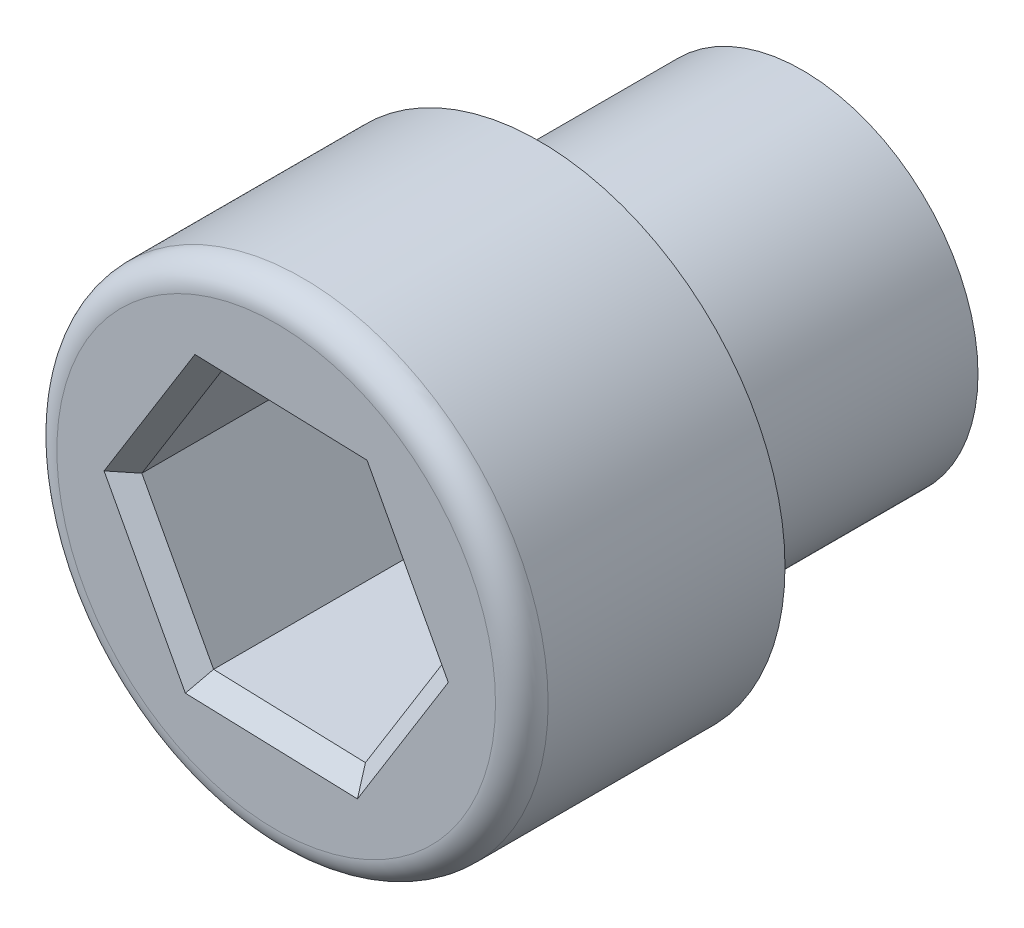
ISO-10303-21;
HEADER;
FILE_DESCRIPTION(('STEP AP214'),'2;1');
FILE_NAME('part.step','',(''),(''),'','','');
FILE_SCHEMA(('AUTOMOTIVE_DESIGN { 1 0 10303 214 1 1 1 1 }'));
ENDSEC;
DATA;
#1=APPLICATION_CONTEXT('core data for automotive mechanical design processes');
#2=APPLICATION_PROTOCOL_DEFINITION('international standard','automotive_design',2000,#1);
#3=PRODUCT_CONTEXT('',#1,'mechanical');
#4=PRODUCT('Part','Part','',(#3));
#5=PRODUCT_RELATED_PRODUCT_CATEGORY('part','',(#4));
#6=PRODUCT_DEFINITION_FORMATION('','',#4);
#7=PRODUCT_DEFINITION_CONTEXT('part definition',#1,'design');
#8=PRODUCT_DEFINITION('design','',#6,#7);
#9=PRODUCT_DEFINITION_SHAPE('','',#8);
#10=(LENGTH_UNIT() NAMED_UNIT(*) SI_UNIT(.MILLI.,.METRE.));
#11=(NAMED_UNIT(*) PLANE_ANGLE_UNIT() SI_UNIT($,.RADIAN.));
#12=(NAMED_UNIT(*) SI_UNIT($,.STERADIAN.) SOLID_ANGLE_UNIT());
#13=UNCERTAINTY_MEASURE_WITH_UNIT(LENGTH_MEASURE(1.E-05),#10,'distance_accuracy_value','');
#14=(GEOMETRIC_REPRESENTATION_CONTEXT(3) GLOBAL_UNCERTAINTY_ASSIGNED_CONTEXT((#13)) GLOBAL_UNIT_ASSIGNED_CONTEXT((#10,
#11,#12)) REPRESENTATION_CONTEXT('',''));
#15=CARTESIAN_POINT('',(0.,0.,0.));
#16=DIRECTION('',(0.,0.,1.));
#17=DIRECTION('',(1.,0.,0.));
#18=AXIS2_PLACEMENT_3D('',#15,#16,#17);
#19=CARTESIAN_POINT('',(0.,0.,3.));
#20=DIRECTION('',(0.,0.,-1.));
#21=DIRECTION('',(-1.,0.,0.));
#22=AXIS2_PLACEMENT_3D('',#19,#20,#21);
#23=CYLINDRICAL_SURFACE('',#22,2.);
#24=CARTESIAN_POINT('',(0.,0.,3.));
#25=DIRECTION('',(0.,0.,1.));
#26=DIRECTION('',(1.,0.,0.));
#27=AXIS2_PLACEMENT_3D('',#24,#25,#26);
#28=CIRCLE('',#27,2.);
#29=CARTESIAN_POINT('',(2.,0.,3.));
#30=VERTEX_POINT('',#29);
#31=EDGE_CURVE('E154',#30,#30,#28,.T.);
#32=ORIENTED_EDGE('',*,*,#31,.F.);
#33=EDGE_LOOP('',(#32));
#34=FACE_BOUND('',#33,.T.);
#35=CARTESIAN_POINT('',(0.,0.,0.));
#36=DIRECTION('',(0.,0.,1.));
#37=DIRECTION('',(1.,0.,0.));
#38=AXIS2_PLACEMENT_3D('',#35,#36,#37);
#39=CIRCLE('',#38,2.);
#40=CARTESIAN_POINT('',(2.,0.,0.));
#41=VERTEX_POINT('',#40);
#42=EDGE_CURVE('E153',#41,#41,#39,.T.);
#43=ORIENTED_EDGE('',*,*,#42,.T.);
#44=EDGE_LOOP('',(#43));
#45=FACE_BOUND('',#44,.T.);
#46=ADVANCED_FACE('F33',(#34,#45),#23,.T.);
#47=CARTESIAN_POINT('',(0.,0.,0.));
#48=DIRECTION('',(0.,0.,1.));
#49=DIRECTION('',(1.,0.,0.));
#50=AXIS2_PLACEMENT_3D('',#47,#48,#49);
#51=PLANE('',#50);
#52=ORIENTED_EDGE('',*,*,#42,.F.);
#53=EDGE_LOOP('',(#52));
#54=FACE_BOUND('',#53,.T.);
#55=ADVANCED_FACE('F231',(#54),#51,.F.);
#56=CARTESIAN_POINT('',(0.,0.,6.));
#57=DIRECTION('',(0.,0.,-1.));
#58=DIRECTION('',(-1.,0.,0.));
#59=AXIS2_PLACEMENT_3D('',#56,#57,#58);
#60=CYLINDRICAL_SURFACE('',#59,2.8);
#61=CARTESIAN_POINT('',(0.,0.,5.7));
#62=DIRECTION('',(0.,0.,1.));
#63=DIRECTION('',(1.,0.,0.));
#64=AXIS2_PLACEMENT_3D('',#61,#62,#63);
#65=CIRCLE('',#64,2.8);
#66=CARTESIAN_POINT('',(2.8,0.,5.7));
#67=VERTEX_POINT('',#66);
#68=EDGE_CURVE('E162',#67,#67,#65,.F.);
#69=ORIENTED_EDGE('',*,*,#68,.T.);
#70=EDGE_LOOP('',(#69));
#71=FACE_BOUND('',#70,.T.);
#72=CARTESIAN_POINT('',(0.,0.,3.));
#73=DIRECTION('',(0.,0.,1.));
#74=DIRECTION('',(1.,0.,0.));
#75=AXIS2_PLACEMENT_3D('',#72,#73,#74);
#76=CIRCLE('',#75,2.8);
#77=CARTESIAN_POINT('',(2.8,0.,3.));
#78=VERTEX_POINT('',#77);
#79=EDGE_CURVE('E142',#78,#78,#76,.T.);
#80=ORIENTED_EDGE('',*,*,#79,.T.);
#81=EDGE_LOOP('',(#80));
#82=FACE_BOUND('',#81,.T.);
#83=ADVANCED_FACE('F237',(#71,#82),#60,.T.);
#84=CARTESIAN_POINT('',(0.,0.,6.));
#85=DIRECTION('',(0.,0.,1.));
#86=DIRECTION('',(1.,0.,0.));
#87=AXIS2_PLACEMENT_3D('',#84,#85,#86);
#88=PLANE('',#87);
#89=DIRECTION('',(-0.527537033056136,-0.849532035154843,0.));
#90=VECTOR('',#89,1.);
#91=CARTESIAN_POINT('',(0.987343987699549,-1.63252927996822,6.));
#92=LINE('',#91,#90);
#93=CARTESIAN_POINT('',(1.96197966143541,-0.0630011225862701,6.));
#94=VERTEX_POINT('',#93);
#95=CARTESIAN_POINT('',(0.926429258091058,-1.73062478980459,6.));
#96=VERTEX_POINT('',#95);
#97=EDGE_CURVE('E168',#94,#96,#92,.T.);
#98=ORIENTED_EDGE('',*,*,#97,.T.);
#99=DIRECTION('',(-0.999484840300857,0.0320944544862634,0.));
#100=VECTOR('',#99,1.);
#101=CARTESIAN_POINT('',(-0.920139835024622,-1.67132961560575,6.));
#102=LINE('',#101,#100);
#103=CARTESIAN_POINT('',(-1.03555040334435,-1.66762366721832,6.));
#104=VERTEX_POINT('',#103);
#105=EDGE_CURVE('E178',#96,#104,#102,.T.);
#106=ORIENTED_EDGE('',*,*,#105,.T.);
#107=DIRECTION('',(-0.471947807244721,0.881626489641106,0.));
#108=VECTOR('',#107,1.);
#109=CARTESIAN_POINT('',(-1.90748382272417,-0.0388003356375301,6.));
#110=LINE('',#109,#108);
#111=CARTESIAN_POINT('',(-1.96197966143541,0.0630011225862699,6.));
#112=VERTEX_POINT('',#111);
#113=EDGE_CURVE('E176',#104,#112,#110,.T.);
#114=ORIENTED_EDGE('',*,*,#113,.T.);
#115=DIRECTION('',(0.527537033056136,0.849532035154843,0.));
#116=VECTOR('',#115,1.);
#117=CARTESIAN_POINT('',(-0.987343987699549,1.63252927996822,6.));
#118=LINE('',#117,#116);
#119=CARTESIAN_POINT('',(-0.926429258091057,1.73062478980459,6.));
#120=VERTEX_POINT('',#119);
#121=EDGE_CURVE('E174',#112,#120,#118,.T.);
#122=ORIENTED_EDGE('',*,*,#121,.T.);
#123=DIRECTION('',(0.999484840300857,-0.0320944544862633,0.));
#124=VECTOR('',#123,1.);
#125=CARTESIAN_POINT('',(0.920139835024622,1.67132961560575,6.));
#126=LINE('',#125,#124);
#127=CARTESIAN_POINT('',(1.03555040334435,1.66762366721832,6.));
#128=VERTEX_POINT('',#127);
#129=EDGE_CURVE('E172',#120,#128,#126,.T.);
#130=ORIENTED_EDGE('',*,*,#129,.T.);
#131=DIRECTION('',(0.471947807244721,-0.881626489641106,0.));
#132=VECTOR('',#131,1.);
#133=CARTESIAN_POINT('',(1.90748382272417,0.03880033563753,6.));
#134=LINE('',#133,#132);
#135=EDGE_CURVE('E170',#128,#94,#134,.T.);
#136=ORIENTED_EDGE('',*,*,#135,.T.);
#137=EDGE_LOOP('',(#98,#106,#114,#122,#130,#136));
#138=FACE_BOUND('',#137,.T.);
#139=CARTESIAN_POINT('',(0.,0.,6.));
#140=DIRECTION('',(0.,0.,1.));
#141=DIRECTION('',(1.,0.,0.));
#142=AXIS2_PLACEMENT_3D('',#139,#140,#141);
#143=CIRCLE('',#142,2.5);
#144=CARTESIAN_POINT('',(2.5,0.,6.));
#145=VERTEX_POINT('',#144);
#146=EDGE_CURVE('E157',#145,#145,#143,.T.);
#147=ORIENTED_EDGE('',*,*,#146,.T.);
#148=EDGE_LOOP('',(#147));
#149=FACE_BOUND('',#148,.T.);
#150=ADVANCED_FACE('F278',(#138,#149),#88,.T.);
#151=CARTESIAN_POINT('',(0.,0.,3.));
#152=DIRECTION('',(0.,0.,1.));
#153=DIRECTION('',(1.,0.,0.));
#154=AXIS2_PLACEMENT_3D('',#151,#152,#153);
#155=PLANE('',#154);
#156=ORIENTED_EDGE('',*,*,#31,.T.);
#157=EDGE_LOOP('',(#156));
#158=FACE_BOUND('',#157,.T.);
#159=ORIENTED_EDGE('',*,*,#79,.F.);
#160=EDGE_LOOP('',(#159));
#161=FACE_BOUND('',#160,.T.);
#162=ADVANCED_FACE('F246',(#158,#161),#155,.F.);
#163=CARTESIAN_POINT('',(0.,0.,5.7));
#164=DIRECTION('',(0.,0.,1.));
#165=DIRECTION('',(1.,0.,0.));
#166=AXIS2_PLACEMENT_3D('',#163,#164,#165);
#167=TOROIDAL_SURFACE('',#166,2.5,0.3);
#168=ORIENTED_EDGE('',*,*,#68,.F.);
#169=EDGE_LOOP('',(#168));
#170=FACE_BOUND('',#169,.T.);
#171=ORIENTED_EDGE('',*,*,#146,.F.);
#172=EDGE_LOOP('',(#171));
#173=FACE_BOUND('',#172,.T.);
#174=ADVANCED_FACE('F227',(#170,#173),#167,.T.);
#175=CARTESIAN_POINT('',(0.91372094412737,1.47143264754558,3.));
#176=DIRECTION('',(0.0320944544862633,0.999484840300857,0.));
#177=DIRECTION('',(-0.999484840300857,0.0320944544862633,0.));
#178=AXIS2_PLACEMENT_3D('',#175,#176,#177);
#179=PLANE('',#178);
#180=DIRECTION('',(0.,0.,1.));
#181=VECTOR('',#180,1.);
#182=CARTESIAN_POINT('',(0.91372094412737,1.47143264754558,3.));
#183=LINE('',#182,#181);
#184=CARTESIAN_POINT('',(0.91372094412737,1.47143264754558,3.));
#185=VERTEX_POINT('',#184);
#186=CARTESIAN_POINT('',(0.91372094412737,1.47143264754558,5.8));
#187=VERTEX_POINT('',#186);
#188=EDGE_CURVE('E140',#185,#187,#183,.T.);
#189=ORIENTED_EDGE('',*,*,#188,.T.);
#190=DIRECTION('',(-0.999484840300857,0.0320944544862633,0.));
#191=VECTOR('',#190,1.);
#192=CARTESIAN_POINT('',(-0.81743758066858,1.52702187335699,5.8));
#193=LINE('',#192,#191);
#194=CARTESIAN_POINT('',(-0.81743758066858,1.52702187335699,5.8));
#195=VERTEX_POINT('',#194);
#196=EDGE_CURVE('E111',#187,#195,#193,.T.);
#197=ORIENTED_EDGE('',*,*,#196,.T.);
#198=DIRECTION('',(0.,0.,1.));
#199=VECTOR('',#198,1.);
#200=CARTESIAN_POINT('',(-0.81743758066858,1.52702187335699,3.));
#201=LINE('',#200,#199);
#202=CARTESIAN_POINT('',(-0.81743758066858,1.52702187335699,3.));
#203=VERTEX_POINT('',#202);
#204=EDGE_CURVE('E104',#203,#195,#201,.T.);
#205=ORIENTED_EDGE('',*,*,#204,.F.);
#206=DIRECTION('',(-0.999484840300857,0.0320944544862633,0.));
#207=VECTOR('',#206,1.);
#208=CARTESIAN_POINT('',(0.91372094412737,1.47143264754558,3.));
#209=LINE('',#208,#207);
#210=EDGE_CURVE('E108',#185,#203,#209,.T.);
#211=ORIENTED_EDGE('',*,*,#210,.F.);
#212=EDGE_LOOP('',(#189,#197,#205,#211));
#213=FACE_BOUND('',#212,.T.);
#214=ADVANCED_FACE('F106',(#213),#179,.F.);
#215=CARTESIAN_POINT('',(1.73115852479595,-0.0555892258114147,3.));
#216=DIRECTION('',(0.881626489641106,0.471947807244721,0.));
#217=DIRECTION('',(-0.471947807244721,0.881626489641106,0.));
#218=AXIS2_PLACEMENT_3D('',#215,#216,#217);
#219=PLANE('',#218);
#220=DIRECTION('',(0.,0.,1.));
#221=VECTOR('',#220,1.);
#222=CARTESIAN_POINT('',(1.73115852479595,-0.0555892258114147,3.));
#223=LINE('',#222,#221);
#224=CARTESIAN_POINT('',(1.73115852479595,-0.0555892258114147,3.));
#225=VERTEX_POINT('',#224);
#226=CARTESIAN_POINT('',(1.73115852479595,-0.0555892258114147,5.8));
#227=VERTEX_POINT('',#226);
#228=EDGE_CURVE('E143',#225,#227,#223,.T.);
#229=ORIENTED_EDGE('',*,*,#228,.T.);
#230=DIRECTION('',(-0.471947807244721,0.881626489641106,0.));
#231=VECTOR('',#230,1.);
#232=CARTESIAN_POINT('',(0.91372094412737,1.47143264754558,5.8));
#233=LINE('',#232,#231);
#234=EDGE_CURVE('E42',#227,#187,#233,.T.);
#235=ORIENTED_EDGE('',*,*,#234,.T.);
#236=ORIENTED_EDGE('',*,*,#188,.F.);
#237=DIRECTION('',(-0.471947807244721,0.881626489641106,0.));
#238=VECTOR('',#237,1.);
#239=CARTESIAN_POINT('',(1.73115852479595,-0.0555892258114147,3.));
#240=LINE('',#239,#238);
#241=EDGE_CURVE('E115',#225,#185,#240,.T.);
#242=ORIENTED_EDGE('',*,*,#241,.F.);
#243=EDGE_LOOP('',(#229,#235,#236,#242));
#244=FACE_BOUND('',#243,.T.);
#245=ADVANCED_FACE('F219',(#244),#219,.F.);
#246=CARTESIAN_POINT('',(0.81743758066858,-1.52702187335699,3.));
#247=DIRECTION('',(0.849532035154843,-0.527537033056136,0.));
#248=DIRECTION('',(0.527537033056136,0.849532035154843,0.));
#249=AXIS2_PLACEMENT_3D('',#246,#247,#248);
#250=PLANE('',#249);
#251=DIRECTION('',(0.,0.,1.));
#252=VECTOR('',#251,1.);
#253=CARTESIAN_POINT('',(0.81743758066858,-1.52702187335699,3.));
#254=LINE('',#253,#252);
#255=CARTESIAN_POINT('',(0.81743758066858,-1.52702187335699,3.));
#256=VERTEX_POINT('',#255);
#257=CARTESIAN_POINT('',(0.81743758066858,-1.52702187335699,5.8));
#258=VERTEX_POINT('',#257);
#259=EDGE_CURVE('E145',#256,#258,#254,.T.);
#260=ORIENTED_EDGE('',*,*,#259,.T.);
#261=DIRECTION('',(0.527537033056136,0.849532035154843,0.));
#262=VECTOR('',#261,1.);
#263=CARTESIAN_POINT('',(1.73115852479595,-0.0555892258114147,5.8));
#264=LINE('',#263,#262);
#265=EDGE_CURVE('E11',#258,#227,#264,.T.);
#266=ORIENTED_EDGE('',*,*,#265,.T.);
#267=ORIENTED_EDGE('',*,*,#228,.F.);
#268=DIRECTION('',(0.527537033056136,0.849532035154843,0.));
#269=VECTOR('',#268,1.);
#270=CARTESIAN_POINT('',(0.81743758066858,-1.52702187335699,3.));
#271=LINE('',#270,#269);
#272=EDGE_CURVE('E137',#256,#225,#271,.T.);
#273=ORIENTED_EDGE('',*,*,#272,.F.);
#274=EDGE_LOOP('',(#260,#266,#267,#273));
#275=FACE_BOUND('',#274,.T.);
#276=ADVANCED_FACE('F218',(#275),#250,.F.);
#277=CARTESIAN_POINT('',(-0.913720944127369,-1.47143264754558,3.));
#278=DIRECTION('',(-0.0320944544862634,-0.999484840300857,0.));
#279=DIRECTION('',(0.999484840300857,-0.0320944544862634,0.));
#280=AXIS2_PLACEMENT_3D('',#277,#278,#279);
#281=PLANE('',#280);
#282=DIRECTION('',(0.,0.,1.));
#283=VECTOR('',#282,1.);
#284=CARTESIAN_POINT('',(-0.913720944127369,-1.47143264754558,3.));
#285=LINE('',#284,#283);
#286=CARTESIAN_POINT('',(-0.913720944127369,-1.47143264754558,3.));
#287=VERTEX_POINT('',#286);
#288=CARTESIAN_POINT('',(-0.913720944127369,-1.47143264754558,5.8));
#289=VERTEX_POINT('',#288);
#290=EDGE_CURVE('E147',#287,#289,#285,.T.);
#291=ORIENTED_EDGE('',*,*,#290,.T.);
#292=DIRECTION('',(0.999484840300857,-0.0320944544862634,0.));
#293=VECTOR('',#292,1.);
#294=CARTESIAN_POINT('',(0.81743758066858,-1.52702187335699,5.8));
#295=LINE('',#294,#293);
#296=EDGE_CURVE('E165',#289,#258,#295,.T.);
#297=ORIENTED_EDGE('',*,*,#296,.T.);
#298=ORIENTED_EDGE('',*,*,#259,.F.);
#299=DIRECTION('',(0.999484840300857,-0.0320944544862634,0.));
#300=VECTOR('',#299,1.);
#301=CARTESIAN_POINT('',(-0.913720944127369,-1.47143264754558,3.));
#302=LINE('',#301,#300);
#303=EDGE_CURVE('E134',#287,#256,#302,.T.);
#304=ORIENTED_EDGE('',*,*,#303,.F.);
#305=EDGE_LOOP('',(#291,#297,#298,#304));
#306=FACE_BOUND('',#305,.T.);
#307=ADVANCED_FACE('F215',(#306),#281,.F.);
#308=CARTESIAN_POINT('',(-1.73115852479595,0.0555892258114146,3.));
#309=DIRECTION('',(-0.881626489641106,-0.471947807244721,0.));
#310=DIRECTION('',(0.471947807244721,-0.881626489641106,0.));
#311=AXIS2_PLACEMENT_3D('',#308,#309,#310);
#312=PLANE('',#311);
#313=DIRECTION('',(0.,0.,1.));
#314=VECTOR('',#313,1.);
#315=CARTESIAN_POINT('',(-1.73115852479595,0.0555892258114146,3.));
#316=LINE('',#315,#314);
#317=CARTESIAN_POINT('',(-1.73115852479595,0.0555892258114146,3.));
#318=VERTEX_POINT('',#317);
#319=CARTESIAN_POINT('',(-1.73115852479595,0.0555892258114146,5.8));
#320=VERTEX_POINT('',#319);
#321=EDGE_CURVE('E114',#318,#320,#316,.T.);
#322=ORIENTED_EDGE('',*,*,#321,.T.);
#323=DIRECTION('',(0.471947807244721,-0.881626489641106,0.));
#324=VECTOR('',#323,1.);
#325=CARTESIAN_POINT('',(-0.913720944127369,-1.47143264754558,5.8));
#326=LINE('',#325,#324);
#327=EDGE_CURVE('E181',#320,#289,#326,.T.);
#328=ORIENTED_EDGE('',*,*,#327,.T.);
#329=ORIENTED_EDGE('',*,*,#290,.F.);
#330=DIRECTION('',(0.471947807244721,-0.881626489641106,0.));
#331=VECTOR('',#330,1.);
#332=CARTESIAN_POINT('',(-1.73115852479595,0.0555892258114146,3.));
#333=LINE('',#332,#331);
#334=EDGE_CURVE('E124',#318,#287,#333,.T.);
#335=ORIENTED_EDGE('',*,*,#334,.F.);
#336=EDGE_LOOP('',(#322,#328,#329,#335));
#337=FACE_BOUND('',#336,.T.);
#338=ADVANCED_FACE('F211',(#337),#312,.F.);
#339=CARTESIAN_POINT('',(-0.81743758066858,1.52702187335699,3.));
#340=DIRECTION('',(-0.849532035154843,0.527537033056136,0.));
#341=DIRECTION('',(-0.527537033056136,-0.849532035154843,0.));
#342=AXIS2_PLACEMENT_3D('',#339,#340,#341);
#343=PLANE('',#342);
#344=ORIENTED_EDGE('',*,*,#204,.T.);
#345=DIRECTION('',(-0.527537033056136,-0.849532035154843,0.));
#346=VECTOR('',#345,1.);
#347=CARTESIAN_POINT('',(-1.73115852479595,0.0555892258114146,5.8));
#348=LINE('',#347,#346);
#349=EDGE_CURVE('E183',#195,#320,#348,.T.);
#350=ORIENTED_EDGE('',*,*,#349,.T.);
#351=ORIENTED_EDGE('',*,*,#321,.F.);
#352=DIRECTION('',(-0.527537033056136,-0.849532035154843,0.));
#353=VECTOR('',#352,1.);
#354=CARTESIAN_POINT('',(-0.81743758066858,1.52702187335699,3.));
#355=LINE('',#354,#353);
#356=EDGE_CURVE('E118',#203,#318,#355,.T.);
#357=ORIENTED_EDGE('',*,*,#356,.F.);
#358=EDGE_LOOP('',(#344,#350,#351,#357));
#359=FACE_BOUND('',#358,.T.);
#360=ADVANCED_FACE('F119',(#359),#343,.F.);
#361=CARTESIAN_POINT('',(0.,0.,3.));
#362=DIRECTION('',(0.,0.,1.));
#363=DIRECTION('',(1.,0.,0.));
#364=AXIS2_PLACEMENT_3D('',#361,#362,#363);
#365=PLANE('',#364);
#366=ORIENTED_EDGE('',*,*,#210,.T.);
#367=ORIENTED_EDGE('',*,*,#356,.T.);
#368=ORIENTED_EDGE('',*,*,#334,.T.);
#369=ORIENTED_EDGE('',*,*,#303,.T.);
#370=ORIENTED_EDGE('',*,*,#272,.T.);
#371=ORIENTED_EDGE('',*,*,#241,.T.);
#372=EDGE_LOOP('',(#366,#367,#368,#369,#370,#371));
#373=FACE_BOUND('',#372,.T.);
#374=ADVANCED_FACE('F126',(#373),#365,.T.);
#375=CARTESIAN_POINT('',(0.91372094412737,1.47143264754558,5.8));
#376=DIRECTION('',(-0.0226942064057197,-0.706742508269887,0.70710678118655));
#377=DIRECTION('',(0.999484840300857,-0.0320944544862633,0.));
#378=AXIS2_PLACEMENT_3D('',#375,#376,#377);
#379=PLANE('',#378);
#380=DIRECTION('',(-0.398780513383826,-0.642185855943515,-0.654653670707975));
#381=VECTOR('',#380,1.);
#382=CARTESIAN_POINT('',(0.913720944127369,1.47143264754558,5.8));
#383=LINE('',#382,#381);
#384=EDGE_CURVE('E131',#128,#187,#383,.T.);
#385=ORIENTED_EDGE('',*,*,#384,.F.);
#386=ORIENTED_EDGE('',*,*,#129,.F.);
#387=DIRECTION('',(0.356759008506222,-0.666446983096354,-0.654653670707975));
#388=VECTOR('',#387,1.);
#389=CARTESIAN_POINT('',(-0.81743758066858,1.52702187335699,5.8));
#390=LINE('',#389,#388);
#391=EDGE_CURVE('E37',#195,#120,#390,.F.);
#392=ORIENTED_EDGE('',*,*,#391,.F.);
#393=ORIENTED_EDGE('',*,*,#196,.F.);
#394=EDGE_LOOP('',(#385,#386,#392,#393));
#395=FACE_BOUND('',#394,.T.);
#396=ADVANCED_FACE('F35',(#395),#379,.T.);
#397=CARTESIAN_POINT('',(-0.81743758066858,1.52702187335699,5.8));
#398=DIRECTION('',(0.600709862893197,-0.373025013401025,0.707106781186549));
#399=DIRECTION('',(0.527537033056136,0.849532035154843,0.));
#400=AXIS2_PLACEMENT_3D('',#397,#398,#399);
#401=PLANE('',#400);
#402=ORIENTED_EDGE('',*,*,#391,.T.);
#403=ORIENTED_EDGE('',*,*,#121,.F.);
#404=DIRECTION('',(0.755539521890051,-0.0242611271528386,-0.654653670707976));
#405=VECTOR('',#404,1.);
#406=CARTESIAN_POINT('',(-1.73115852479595,0.0555892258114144,5.8));
#407=LINE('',#406,#405);
#408=EDGE_CURVE('E194',#320,#112,#407,.F.);
#409=ORIENTED_EDGE('',*,*,#408,.F.);
#410=ORIENTED_EDGE('',*,*,#349,.F.);
#411=EDGE_LOOP('',(#402,#403,#409,#410));
#412=FACE_BOUND('',#411,.T.);
#413=ADVANCED_FACE('F208',(#412),#401,.T.);
#414=CARTESIAN_POINT('',(1.73115852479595,-0.0555892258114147,5.8));
#415=DIRECTION('',(-0.623404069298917,-0.333717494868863,0.707106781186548));
#416=DIRECTION('',(0.471947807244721,-0.881626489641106,0.));
#417=AXIS2_PLACEMENT_3D('',#414,#415,#416);
#418=PLANE('',#417);
#419=ORIENTED_EDGE('',*,*,#384,.T.);
#420=ORIENTED_EDGE('',*,*,#234,.F.);
#421=DIRECTION('',(-0.755539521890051,0.0242611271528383,-0.654653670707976));
#422=VECTOR('',#421,1.);
#423=CARTESIAN_POINT('',(1.73115852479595,-0.0555892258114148,5.8));
#424=LINE('',#423,#422);
#425=EDGE_CURVE('E191',#94,#227,#424,.T.);
#426=ORIENTED_EDGE('',*,*,#425,.F.);
#427=ORIENTED_EDGE('',*,*,#135,.F.);
#428=EDGE_LOOP('',(#419,#420,#426,#427));
#429=FACE_BOUND('',#428,.T.);
#430=ADVANCED_FACE('F200',(#429),#418,.T.);
#431=CARTESIAN_POINT('',(-1.73115852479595,0.0555892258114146,5.8));
#432=DIRECTION('',(0.623404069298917,0.333717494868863,0.707106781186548));
#433=DIRECTION('',(-0.471947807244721,0.881626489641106,0.));
#434=AXIS2_PLACEMENT_3D('',#431,#432,#433);
#435=PLANE('',#434);
#436=ORIENTED_EDGE('',*,*,#408,.T.);
#437=ORIENTED_EDGE('',*,*,#113,.F.);
#438=DIRECTION('',(0.398780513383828,0.642185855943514,-0.654653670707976));
#439=VECTOR('',#438,1.);
#440=CARTESIAN_POINT('',(-0.913720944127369,-1.47143264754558,5.8));
#441=LINE('',#440,#439);
#442=EDGE_CURVE('E189',#289,#104,#441,.F.);
#443=ORIENTED_EDGE('',*,*,#442,.F.);
#444=ORIENTED_EDGE('',*,*,#327,.F.);
#445=EDGE_LOOP('',(#436,#437,#443,#444));
#446=FACE_BOUND('',#445,.T.);
#447=ADVANCED_FACE('F255',(#446),#435,.T.);
#448=CARTESIAN_POINT('',(0.81743758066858,-1.52702187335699,5.8));
#449=DIRECTION('',(-0.600709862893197,0.373025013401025,0.707106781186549));
#450=DIRECTION('',(-0.527537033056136,-0.849532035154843,0.));
#451=AXIS2_PLACEMENT_3D('',#448,#449,#450);
#452=PLANE('',#451);
#453=ORIENTED_EDGE('',*,*,#425,.T.);
#454=ORIENTED_EDGE('',*,*,#265,.F.);
#455=DIRECTION('',(0.356759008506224,-0.666446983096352,0.654653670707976));
#456=VECTOR('',#455,1.);
#457=CARTESIAN_POINT('',(0.583883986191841,-1.09072990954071,5.37142857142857));
#458=LINE('',#457,#456);
#459=EDGE_CURVE('E187',#96,#258,#458,.F.);
#460=ORIENTED_EDGE('',*,*,#459,.F.);
#461=ORIENTED_EDGE('',*,*,#97,.F.);
#462=EDGE_LOOP('',(#453,#454,#460,#461));
#463=FACE_BOUND('',#462,.T.);
#464=ADVANCED_FACE('F251',(#463),#452,.T.);
#465=CARTESIAN_POINT('',(-0.913720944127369,-1.47143264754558,5.8));
#466=DIRECTION('',(0.0226942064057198,0.706742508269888,0.707106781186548));
#467=DIRECTION('',(-0.999484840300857,0.0320944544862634,0.));
#468=AXIS2_PLACEMENT_3D('',#465,#466,#467);
#469=PLANE('',#468);
#470=ORIENTED_EDGE('',*,*,#442,.T.);
#471=ORIENTED_EDGE('',*,*,#105,.F.);
#472=ORIENTED_EDGE('',*,*,#459,.T.);
#473=ORIENTED_EDGE('',*,*,#296,.F.);
#474=EDGE_LOOP('',(#470,#471,#472,#473));
#475=FACE_BOUND('',#474,.T.);
#476=ADVANCED_FACE('F248',(#475),#469,.T.);
#477=CLOSED_SHELL('',(#46,#55,#83,#150,#162,#174,#214,#245,#276,#307,#338,#360,#374,#396,#413,
#430,#447,#464,#476));
#478=MANIFOLD_SOLID_BREP('B2',#477);
#479=ADVANCED_BREP_SHAPE_REPRESENTATION('',(#18,#478),#14);
#480=SHAPE_DEFINITION_REPRESENTATION(#9,#479);
ENDSEC;
END-ISO-10303-21;
